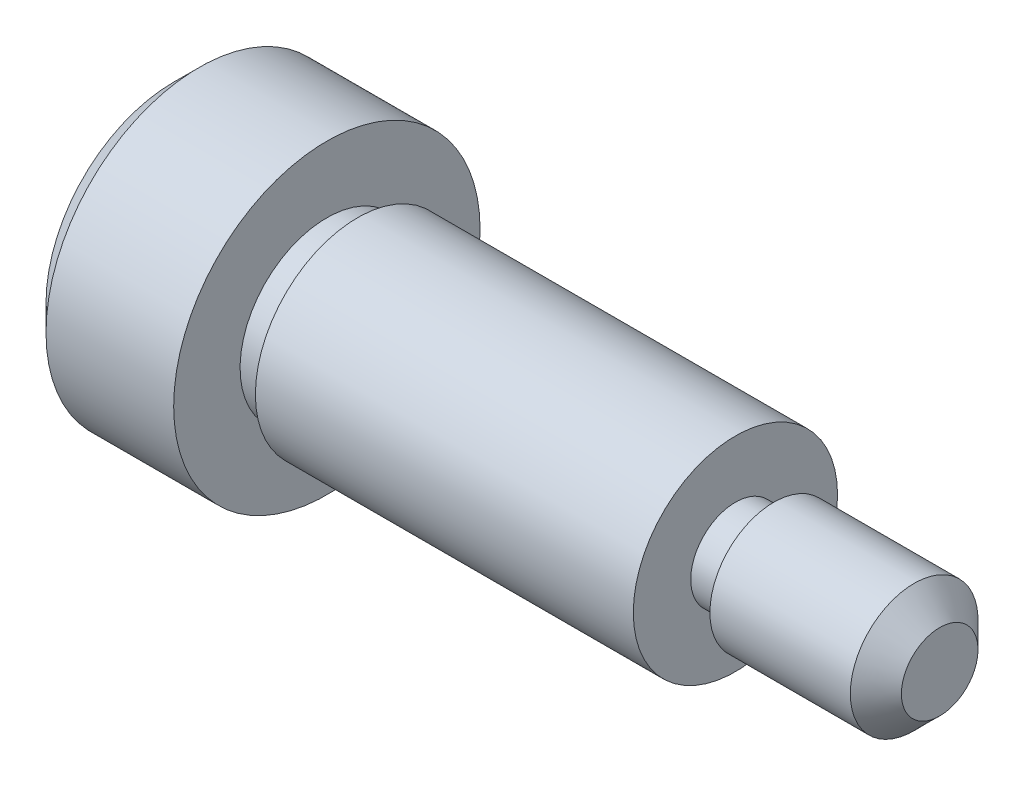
ISO-10303-21;
HEADER;
FILE_DESCRIPTION(('STEP AP214'),'2;1');
FILE_NAME('part.step','',(''),(''),'','','');
FILE_SCHEMA(('AUTOMOTIVE_DESIGN { 1 0 10303 214 1 1 1 1 }'));
ENDSEC;
DATA;
#1=APPLICATION_CONTEXT('core data for automotive mechanical design processes');
#2=APPLICATION_PROTOCOL_DEFINITION('international standard','automotive_design',2000,#1);
#3=PRODUCT_CONTEXT('',#1,'mechanical');
#4=PRODUCT('Part','Part','',(#3));
#5=PRODUCT_RELATED_PRODUCT_CATEGORY('part','',(#4));
#6=PRODUCT_DEFINITION_FORMATION('','',#4);
#7=PRODUCT_DEFINITION_CONTEXT('part definition',#1,'design');
#8=PRODUCT_DEFINITION('design','',#6,#7);
#9=PRODUCT_DEFINITION_SHAPE('','',#8);
#10=(LENGTH_UNIT() NAMED_UNIT(*) SI_UNIT(.MILLI.,.METRE.));
#11=(NAMED_UNIT(*) PLANE_ANGLE_UNIT() SI_UNIT($,.RADIAN.));
#12=(NAMED_UNIT(*) SI_UNIT($,.STERADIAN.) SOLID_ANGLE_UNIT());
#13=UNCERTAINTY_MEASURE_WITH_UNIT(LENGTH_MEASURE(1.E-05),#10,'distance_accuracy_value','');
#14=(GEOMETRIC_REPRESENTATION_CONTEXT(3) GLOBAL_UNCERTAINTY_ASSIGNED_CONTEXT((#13)) GLOBAL_UNIT_ASSIGNED_CONTEXT((#10,
#11,#12)) REPRESENTATION_CONTEXT('',''));
#15=CARTESIAN_POINT('',(0.,0.,0.));
#16=DIRECTION('',(0.,0.,1.));
#17=DIRECTION('',(1.,0.,0.));
#18=AXIS2_PLACEMENT_3D('',#15,#16,#17);
#19=CARTESIAN_POINT('',(0.,0.,0.));
#20=DIRECTION('',(-1.,0.,0.));
#21=DIRECTION('',(0.,0.,1.));
#22=AXIS2_PLACEMENT_3D('',#19,#20,#21);
#23=CYLINDRICAL_SURFACE('',#22,2.);
#24=CARTESIAN_POINT('',(8.,0.,0.));
#25=DIRECTION('',(-1.,0.,0.));
#26=DIRECTION('',(0.,0.,1.));
#27=AXIS2_PLACEMENT_3D('',#24,#25,#26);
#28=CIRCLE('',#27,2.);
#29=CARTESIAN_POINT('',(8.,0.,2.));
#30=VERTEX_POINT('',#29);
#31=EDGE_CURVE('E161',#30,#30,#28,.T.);
#32=ORIENTED_EDGE('',*,*,#31,.T.);
#33=EDGE_LOOP('',(#32));
#34=FACE_BOUND('',#33,.T.);
#35=CARTESIAN_POINT('',(0.600000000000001,0.,0.));
#36=DIRECTION('',(-1.,0.,0.));
#37=DIRECTION('',(0.,-1.,0.));
#38=AXIS2_PLACEMENT_3D('',#35,#36,#37);
#39=CIRCLE('',#38,2.);
#40=CARTESIAN_POINT('',(0.600000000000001,-2.,0.));
#41=VERTEX_POINT('',#40);
#42=EDGE_CURVE('E152',#41,#41,#39,.T.);
#43=ORIENTED_EDGE('',*,*,#42,.F.);
#44=EDGE_LOOP('',(#43));
#45=FACE_BOUND('',#44,.T.);
#46=ADVANCED_FACE('F36',(#34,#45),#23,.T.);
#47=CARTESIAN_POINT('',(8.,1.25,0.));
#48=DIRECTION('',(-1.,0.,0.));
#49=DIRECTION('',(0.,0.,1.));
#50=AXIS2_PLACEMENT_3D('',#47,#48,#49);
#51=PLANE('',#50);
#52=ORIENTED_EDGE('',*,*,#31,.F.);
#53=EDGE_LOOP('',(#52));
#54=FACE_BOUND('',#53,.T.);
#55=CARTESIAN_POINT('',(8.,0.,0.));
#56=DIRECTION('',(-1.,0.,0.));
#57=DIRECTION('',(0.,-1.,0.));
#58=AXIS2_PLACEMENT_3D('',#55,#56,#57);
#59=CIRCLE('',#58,0.875000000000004);
#60=CARTESIAN_POINT('',(8.,-0.875000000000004,0.));
#61=VERTEX_POINT('',#60);
#62=EDGE_CURVE('E146',#61,#61,#59,.T.);
#63=ORIENTED_EDGE('',*,*,#62,.T.);
#64=EDGE_LOOP('',(#63));
#65=FACE_BOUND('',#64,.T.);
#66=ADVANCED_FACE('F187',(#54,#65),#51,.F.);
#67=CARTESIAN_POINT('',(0.6,2.,0.));
#68=DIRECTION('',(-1.,0.,0.));
#69=DIRECTION('',(0.,-1.,0.));
#70=AXIS2_PLACEMENT_3D('',#67,#68,#69);
#71=PLANE('',#70);
#72=ORIENTED_EDGE('',*,*,#42,.T.);
#73=EDGE_LOOP('',(#72));
#74=FACE_BOUND('',#73,.T.);
#75=CARTESIAN_POINT('',(0.6,0.,0.));
#76=DIRECTION('',(-1.,0.,0.));
#77=DIRECTION('',(0.,-1.,0.));
#78=AXIS2_PLACEMENT_3D('',#75,#76,#77);
#79=CIRCLE('',#78,1.7);
#80=CARTESIAN_POINT('',(0.6,-1.7,0.));
#81=VERTEX_POINT('',#80);
#82=EDGE_CURVE('E158',#81,#81,#79,.T.);
#83=ORIENTED_EDGE('',*,*,#82,.F.);
#84=EDGE_LOOP('',(#83));
#85=FACE_BOUND('',#84,.T.);
#86=ADVANCED_FACE('F193',(#74,#85),#71,.T.);
#87=CARTESIAN_POINT('',(0.,0.,0.));
#88=DIRECTION('',(-1.,0.,0.));
#89=DIRECTION('',(0.,-1.,0.));
#90=AXIS2_PLACEMENT_3D('',#87,#88,#89);
#91=CYLINDRICAL_SURFACE('',#90,1.7);
#92=ORIENTED_EDGE('',*,*,#82,.T.);
#93=EDGE_LOOP('',(#92));
#94=FACE_BOUND('',#93,.T.);
#95=CARTESIAN_POINT('',(0.,0.,0.));
#96=DIRECTION('',(-1.,0.,0.));
#97=DIRECTION('',(0.,-1.,0.));
#98=AXIS2_PLACEMENT_3D('',#95,#96,#97);
#99=CIRCLE('',#98,1.7);
#100=CARTESIAN_POINT('',(0.,-1.7,0.));
#101=VERTEX_POINT('',#100);
#102=EDGE_CURVE('E155',#101,#101,#99,.T.);
#103=ORIENTED_EDGE('',*,*,#102,.F.);
#104=EDGE_LOOP('',(#103));
#105=FACE_BOUND('',#104,.T.);
#106=ADVANCED_FACE('F210',(#94,#105),#91,.T.);
#107=CARTESIAN_POINT('',(-3.,3.,0.));
#108=DIRECTION('',(1.,0.,0.));
#109=DIRECTION('',(0.,0.,-1.));
#110=AXIS2_PLACEMENT_3D('',#107,#108,#109);
#111=PLANE('',#110);
#112=CARTESIAN_POINT('',(-3.,0.,0.));
#113=DIRECTION('',(1.,0.,0.));
#114=DIRECTION('',(0.,0.,-1.));
#115=AXIS2_PLACEMENT_3D('',#112,#113,#114);
#116=CIRCLE('',#115,2.5);
#117=CARTESIAN_POINT('',(-3.,0.,-2.5));
#118=VERTEX_POINT('',#117);
#119=EDGE_CURVE('E44',#118,#118,#116,.F.);
#120=ORIENTED_EDGE('',*,*,#119,.T.);
#121=EDGE_LOOP('',(#120));
#122=FACE_BOUND('',#121,.T.);
#123=DIRECTION('',(0.,0.,-1.));
#124=VECTOR('',#123,1.);
#125=CARTESIAN_POINT('',(-3.,1.,0.577350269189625));
#126=LINE('',#125,#124);
#127=CARTESIAN_POINT('',(-3.,1.,0.577350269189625));
#128=VERTEX_POINT('',#127);
#129=CARTESIAN_POINT('',(-3.,0.999999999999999,-0.577350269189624));
#130=VERTEX_POINT('',#129);
#131=EDGE_CURVE('E125',#128,#130,#126,.T.);
#132=ORIENTED_EDGE('',*,*,#131,.F.);
#133=DIRECTION('',(0.,0.866025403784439,-0.5));
#134=VECTOR('',#133,1.);
#135=CARTESIAN_POINT('',(-3.,0.,1.15470053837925));
#136=LINE('',#135,#134);
#137=CARTESIAN_POINT('',(-3.,0.,1.15470053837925));
#138=VERTEX_POINT('',#137);
#139=EDGE_CURVE('E51',#138,#128,#136,.T.);
#140=ORIENTED_EDGE('',*,*,#139,.F.);
#141=DIRECTION('',(0.,0.866025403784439,0.5));
#142=VECTOR('',#141,1.);
#143=CARTESIAN_POINT('',(-3.,-1.,0.577350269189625));
#144=LINE('',#143,#142);
#145=CARTESIAN_POINT('',(-3.,-1.,0.577350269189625));
#146=VERTEX_POINT('',#145);
#147=EDGE_CURVE('E134',#146,#138,#144,.T.);
#148=ORIENTED_EDGE('',*,*,#147,.F.);
#149=DIRECTION('',(0.,0.,1.));
#150=VECTOR('',#149,1.);
#151=CARTESIAN_POINT('',(-3.,-1.,-0.577350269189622));
#152=LINE('',#151,#150);
#153=CARTESIAN_POINT('',(-3.,-1.,-0.577350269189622));
#154=VERTEX_POINT('',#153);
#155=EDGE_CURVE('E132',#154,#146,#152,.T.);
#156=ORIENTED_EDGE('',*,*,#155,.F.);
#157=DIRECTION('',(0.,-0.866025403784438,0.5));
#158=VECTOR('',#157,1.);
#159=CARTESIAN_POINT('',(-3.,0.,-1.15470053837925));
#160=LINE('',#159,#158);
#161=CARTESIAN_POINT('',(-3.,0.,-1.15470053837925));
#162=VERTEX_POINT('',#161);
#163=EDGE_CURVE('E99',#162,#154,#160,.T.);
#164=ORIENTED_EDGE('',*,*,#163,.F.);
#165=DIRECTION('',(0.,-0.866025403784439,-0.5));
#166=VECTOR('',#165,1.);
#167=CARTESIAN_POINT('',(-3.,0.999999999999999,-0.577350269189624));
#168=LINE('',#167,#166);
#169=EDGE_CURVE('E128',#130,#162,#168,.T.);
#170=ORIENTED_EDGE('',*,*,#169,.F.);
#171=EDGE_LOOP('',(#132,#140,#148,#156,#164,#170));
#172=FACE_BOUND('',#171,.T.);
#173=ADVANCED_FACE('F175',(#122,#172),#111,.F.);
#174=CARTESIAN_POINT('',(0.,0.,0.));
#175=DIRECTION('',(-1.,0.,0.));
#176=DIRECTION('',(0.,0.,1.));
#177=AXIS2_PLACEMENT_3D('',#174,#175,#176);
#178=CYLINDRICAL_SURFACE('',#177,3.);
#179=CARTESIAN_POINT('',(-2.5,0.,0.));
#180=DIRECTION('',(1.,0.,0.));
#181=DIRECTION('',(0.,0.,-1.));
#182=AXIS2_PLACEMENT_3D('',#179,#180,#181);
#183=CIRCLE('',#182,3.);
#184=CARTESIAN_POINT('',(-2.5,0.,-3.));
#185=VERTEX_POINT('',#184);
#186=EDGE_CURVE('E11',#185,#185,#183,.T.);
#187=ORIENTED_EDGE('',*,*,#186,.T.);
#188=EDGE_LOOP('',(#187));
#189=FACE_BOUND('',#188,.T.);
#190=CARTESIAN_POINT('',(0.,0.,0.));
#191=DIRECTION('',(-1.,0.,0.));
#192=DIRECTION('',(0.,0.,1.));
#193=AXIS2_PLACEMENT_3D('',#190,#191,#192);
#194=CIRCLE('',#193,3.);
#195=CARTESIAN_POINT('',(0.,0.,3.));
#196=VERTEX_POINT('',#195);
#197=EDGE_CURVE('E164',#196,#196,#194,.T.);
#198=ORIENTED_EDGE('',*,*,#197,.T.);
#199=EDGE_LOOP('',(#198));
#200=FACE_BOUND('',#199,.T.);
#201=ADVANCED_FACE('F203',(#189,#200),#178,.T.);
#202=CARTESIAN_POINT('',(0.,2.,0.));
#203=DIRECTION('',(-1.,0.,0.));
#204=DIRECTION('',(0.,0.,1.));
#205=AXIS2_PLACEMENT_3D('',#202,#203,#204);
#206=PLANE('',#205);
#207=ORIENTED_EDGE('',*,*,#197,.F.);
#208=EDGE_LOOP('',(#207));
#209=FACE_BOUND('',#208,.T.);
#210=ORIENTED_EDGE('',*,*,#102,.T.);
#211=EDGE_LOOP('',(#210));
#212=FACE_BOUND('',#211,.T.);
#213=ADVANCED_FACE('F199',(#209,#212),#206,.F.);
#214=CARTESIAN_POINT('',(8.75,1.25,0.));
#215=DIRECTION('',(-1.,0.,0.));
#216=DIRECTION('',(0.,-1.,0.));
#217=AXIS2_PLACEMENT_3D('',#214,#215,#216);
#218=PLANE('',#217);
#219=CARTESIAN_POINT('',(8.75,0.,0.));
#220=DIRECTION('',(-1.,0.,0.));
#221=DIRECTION('',(0.,-1.,0.));
#222=AXIS2_PLACEMENT_3D('',#219,#220,#221);
#223=CIRCLE('',#222,1.25);
#224=CARTESIAN_POINT('',(8.75,-1.25,0.));
#225=VERTEX_POINT('',#224);
#226=EDGE_CURVE('E138',#225,#225,#223,.T.);
#227=ORIENTED_EDGE('',*,*,#226,.T.);
#228=EDGE_LOOP('',(#227));
#229=FACE_BOUND('',#228,.T.);
#230=CARTESIAN_POINT('',(8.75,0.,0.));
#231=DIRECTION('',(-1.,0.,0.));
#232=DIRECTION('',(0.,-1.,0.));
#233=AXIS2_PLACEMENT_3D('',#230,#231,#232);
#234=CIRCLE('',#233,0.875000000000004);
#235=CARTESIAN_POINT('',(8.75,-0.875000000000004,0.));
#236=VERTEX_POINT('',#235);
#237=EDGE_CURVE('E149',#236,#236,#234,.T.);
#238=ORIENTED_EDGE('',*,*,#237,.F.);
#239=EDGE_LOOP('',(#238));
#240=FACE_BOUND('',#239,.T.);
#241=ADVANCED_FACE('F202',(#229,#240),#218,.T.);
#242=CARTESIAN_POINT('',(0.,0.,0.));
#243=DIRECTION('',(-1.,0.,0.));
#244=DIRECTION('',(0.,-1.,0.));
#245=AXIS2_PLACEMENT_3D('',#242,#243,#244);
#246=CYLINDRICAL_SURFACE('',#245,0.875000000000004);
#247=ORIENTED_EDGE('',*,*,#237,.T.);
#248=EDGE_LOOP('',(#247));
#249=FACE_BOUND('',#248,.T.);
#250=ORIENTED_EDGE('',*,*,#62,.F.);
#251=EDGE_LOOP('',(#250));
#252=FACE_BOUND('',#251,.T.);
#253=ADVANCED_FACE('F214',(#249,#252),#246,.T.);
#254=CARTESIAN_POINT('',(12.,0.,0.));
#255=DIRECTION('',(-1.,0.,0.));
#256=DIRECTION('',(0.,0.,1.));
#257=AXIS2_PLACEMENT_3D('',#254,#255,#256);
#258=PLANE('',#257);
#259=CARTESIAN_POINT('',(12.,0.,0.));
#260=DIRECTION('',(-1.,0.,0.));
#261=DIRECTION('',(0.,0.,1.));
#262=AXIS2_PLACEMENT_3D('',#259,#260,#261);
#263=CIRCLE('',#262,0.749999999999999);
#264=CARTESIAN_POINT('',(12.,0.,0.749999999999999));
#265=VERTEX_POINT('',#264);
#266=EDGE_CURVE('E170',#265,#265,#263,.F.);
#267=ORIENTED_EDGE('',*,*,#266,.T.);
#268=EDGE_LOOP('',(#267));
#269=FACE_BOUND('',#268,.T.);
#270=ADVANCED_FACE('F211',(#269),#258,.F.);
#271=CARTESIAN_POINT('',(0.,0.,0.));
#272=DIRECTION('',(-1.,0.,0.));
#273=DIRECTION('',(0.,0.,1.));
#274=AXIS2_PLACEMENT_3D('',#271,#272,#273);
#275=CYLINDRICAL_SURFACE('',#274,1.25);
#276=CARTESIAN_POINT('',(11.5,0.,0.));
#277=DIRECTION('',(-1.,0.,0.));
#278=DIRECTION('',(0.,0.,1.));
#279=AXIS2_PLACEMENT_3D('',#276,#277,#278);
#280=CIRCLE('',#279,1.25);
#281=CARTESIAN_POINT('',(11.5,0.,1.25));
#282=VERTEX_POINT('',#281);
#283=EDGE_CURVE('E167',#282,#282,#280,.T.);
#284=ORIENTED_EDGE('',*,*,#283,.T.);
#285=EDGE_LOOP('',(#284));
#286=FACE_BOUND('',#285,.T.);
#287=ORIENTED_EDGE('',*,*,#226,.F.);
#288=EDGE_LOOP('',(#287));
#289=FACE_BOUND('',#288,.T.);
#290=ADVANCED_FACE('F213',(#286,#289),#275,.T.);
#291=CARTESIAN_POINT('',(-1.4,0.,1.15470053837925));
#292=DIRECTION('',(0.,0.5,0.866025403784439));
#293=DIRECTION('',(0.,-0.866025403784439,0.5));
#294=AXIS2_PLACEMENT_3D('',#291,#292,#293);
#295=PLANE('',#294);
#296=ORIENTED_EDGE('',*,*,#139,.T.);
#297=DIRECTION('',(-1.,0.,0.));
#298=VECTOR('',#297,1.);
#299=CARTESIAN_POINT('',(-1.4,1.,0.577350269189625));
#300=LINE('',#299,#298);
#301=CARTESIAN_POINT('',(-1.4,1.,0.577350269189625));
#302=VERTEX_POINT('',#301);
#303=EDGE_CURVE('E81',#302,#128,#300,.T.);
#304=ORIENTED_EDGE('',*,*,#303,.F.);
#305=DIRECTION('',(0.,0.866025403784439,-0.5));
#306=VECTOR('',#305,1.);
#307=CARTESIAN_POINT('',(-1.4,0.,1.15470053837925));
#308=LINE('',#307,#306);
#309=CARTESIAN_POINT('',(-1.4,0.,1.15470053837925));
#310=VERTEX_POINT('',#309);
#311=EDGE_CURVE('E136',#310,#302,#308,.T.);
#312=ORIENTED_EDGE('',*,*,#311,.F.);
#313=DIRECTION('',(-1.,0.,0.));
#314=VECTOR('',#313,1.);
#315=CARTESIAN_POINT('',(-1.4,0.,1.15470053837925));
#316=LINE('',#315,#314);
#317=EDGE_CURVE('E59',#310,#138,#316,.T.);
#318=ORIENTED_EDGE('',*,*,#317,.T.);
#319=EDGE_LOOP('',(#296,#304,#312,#318));
#320=FACE_BOUND('',#319,.T.);
#321=ADVANCED_FACE('F220',(#320),#295,.F.);
#322=CARTESIAN_POINT('',(-1.4,-1.,0.577350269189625));
#323=DIRECTION('',(0.,-0.5,0.866025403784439));
#324=DIRECTION('',(0.,-0.866025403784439,-0.5));
#325=AXIS2_PLACEMENT_3D('',#322,#323,#324);
#326=PLANE('',#325);
#327=ORIENTED_EDGE('',*,*,#147,.T.);
#328=ORIENTED_EDGE('',*,*,#317,.F.);
#329=DIRECTION('',(0.,0.866025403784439,0.5));
#330=VECTOR('',#329,1.);
#331=CARTESIAN_POINT('',(-1.4,-1.,0.577350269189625));
#332=LINE('',#331,#330);
#333=CARTESIAN_POINT('',(-1.4,-1.,0.577350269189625));
#334=VERTEX_POINT('',#333);
#335=EDGE_CURVE('E111',#334,#310,#332,.T.);
#336=ORIENTED_EDGE('',*,*,#335,.F.);
#337=DIRECTION('',(-1.,0.,0.));
#338=VECTOR('',#337,1.);
#339=CARTESIAN_POINT('',(-1.4,-1.,0.577350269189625));
#340=LINE('',#339,#338);
#341=EDGE_CURVE('E103',#334,#146,#340,.T.);
#342=ORIENTED_EDGE('',*,*,#341,.T.);
#343=EDGE_LOOP('',(#327,#328,#336,#342));
#344=FACE_BOUND('',#343,.T.);
#345=ADVANCED_FACE('F293',(#344),#326,.F.);
#346=CARTESIAN_POINT('',(-1.4,-1.,-0.577350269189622));
#347=DIRECTION('',(0.,-1.,0.));
#348=DIRECTION('',(0.,0.,-1.));
#349=AXIS2_PLACEMENT_3D('',#346,#347,#348);
#350=PLANE('',#349);
#351=ORIENTED_EDGE('',*,*,#155,.T.);
#352=ORIENTED_EDGE('',*,*,#341,.F.);
#353=DIRECTION('',(0.,0.,1.));
#354=VECTOR('',#353,1.);
#355=CARTESIAN_POINT('',(-1.4,-1.,-0.577350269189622));
#356=LINE('',#355,#354);
#357=CARTESIAN_POINT('',(-1.4,-1.,-0.577350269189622));
#358=VERTEX_POINT('',#357);
#359=EDGE_CURVE('E107',#358,#334,#356,.T.);
#360=ORIENTED_EDGE('',*,*,#359,.F.);
#361=DIRECTION('',(-1.,0.,0.));
#362=VECTOR('',#361,1.);
#363=CARTESIAN_POINT('',(-1.4,-1.,-0.577350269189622));
#364=LINE('',#363,#362);
#365=EDGE_CURVE('E92',#358,#154,#364,.T.);
#366=ORIENTED_EDGE('',*,*,#365,.T.);
#367=EDGE_LOOP('',(#351,#352,#360,#366));
#368=FACE_BOUND('',#367,.T.);
#369=ADVANCED_FACE('F108',(#368),#350,.F.);
#370=CARTESIAN_POINT('',(-1.4,0.,-1.15470053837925));
#371=DIRECTION('',(0.,-0.5,-0.866025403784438));
#372=DIRECTION('',(0.,0.866025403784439,-0.5));
#373=AXIS2_PLACEMENT_3D('',#370,#371,#372);
#374=PLANE('',#373);
#375=ORIENTED_EDGE('',*,*,#163,.T.);
#376=ORIENTED_EDGE('',*,*,#365,.F.);
#377=DIRECTION('',(0.,-0.866025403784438,0.5));
#378=VECTOR('',#377,1.);
#379=CARTESIAN_POINT('',(-1.4,0.,-1.15470053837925));
#380=LINE('',#379,#378);
#381=CARTESIAN_POINT('',(-1.4,0.,-1.15470053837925));
#382=VERTEX_POINT('',#381);
#383=EDGE_CURVE('E96',#382,#358,#380,.T.);
#384=ORIENTED_EDGE('',*,*,#383,.F.);
#385=DIRECTION('',(-1.,0.,0.));
#386=VECTOR('',#385,1.);
#387=CARTESIAN_POINT('',(-1.4,0.,-1.15470053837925));
#388=LINE('',#387,#386);
#389=EDGE_CURVE('E104',#382,#162,#388,.T.);
#390=ORIENTED_EDGE('',*,*,#389,.T.);
#391=EDGE_LOOP('',(#375,#376,#384,#390));
#392=FACE_BOUND('',#391,.T.);
#393=ADVANCED_FACE('F94',(#392),#374,.F.);
#394=CARTESIAN_POINT('',(-1.4,0.999999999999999,-0.577350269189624));
#395=DIRECTION('',(0.,0.5,-0.866025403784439));
#396=DIRECTION('',(0.,0.866025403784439,0.5));
#397=AXIS2_PLACEMENT_3D('',#394,#395,#396);
#398=PLANE('',#397);
#399=ORIENTED_EDGE('',*,*,#169,.T.);
#400=ORIENTED_EDGE('',*,*,#389,.F.);
#401=DIRECTION('',(0.,-0.866025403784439,-0.5));
#402=VECTOR('',#401,1.);
#403=CARTESIAN_POINT('',(-1.4,0.999999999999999,-0.577350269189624));
#404=LINE('',#403,#402);
#405=CARTESIAN_POINT('',(-1.4,0.999999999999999,-0.577350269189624));
#406=VERTEX_POINT('',#405);
#407=EDGE_CURVE('E117',#406,#382,#404,.T.);
#408=ORIENTED_EDGE('',*,*,#407,.F.);
#409=DIRECTION('',(-1.,0.,0.));
#410=VECTOR('',#409,1.);
#411=CARTESIAN_POINT('',(-1.4,0.999999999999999,-0.577350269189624));
#412=LINE('',#411,#410);
#413=EDGE_CURVE('E141',#406,#130,#412,.T.);
#414=ORIENTED_EDGE('',*,*,#413,.T.);
#415=EDGE_LOOP('',(#399,#400,#408,#414));
#416=FACE_BOUND('',#415,.T.);
#417=ADVANCED_FACE('F317',(#416),#398,.F.);
#418=CARTESIAN_POINT('',(-1.4,1.,0.577350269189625));
#419=DIRECTION('',(0.,1.,0.));
#420=DIRECTION('',(0.,0.,1.));
#421=AXIS2_PLACEMENT_3D('',#418,#419,#420);
#422=PLANE('',#421);
#423=ORIENTED_EDGE('',*,*,#131,.T.);
#424=ORIENTED_EDGE('',*,*,#413,.F.);
#425=DIRECTION('',(0.,0.,-1.));
#426=VECTOR('',#425,1.);
#427=CARTESIAN_POINT('',(-1.4,1.,0.577350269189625));
#428=LINE('',#427,#426);
#429=EDGE_CURVE('E119',#302,#406,#428,.T.);
#430=ORIENTED_EDGE('',*,*,#429,.F.);
#431=ORIENTED_EDGE('',*,*,#303,.T.);
#432=EDGE_LOOP('',(#423,#424,#430,#431));
#433=FACE_BOUND('',#432,.T.);
#434=ADVANCED_FACE('F326',(#433),#422,.F.);
#435=CARTESIAN_POINT('',(-1.4,1.,0.577350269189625));
#436=DIRECTION('',(-1.,0.,0.));
#437=DIRECTION('',(0.,0.,1.));
#438=AXIS2_PLACEMENT_3D('',#435,#436,#437);
#439=PLANE('',#438);
#440=ORIENTED_EDGE('',*,*,#311,.T.);
#441=ORIENTED_EDGE('',*,*,#429,.T.);
#442=ORIENTED_EDGE('',*,*,#407,.T.);
#443=ORIENTED_EDGE('',*,*,#383,.T.);
#444=ORIENTED_EDGE('',*,*,#359,.T.);
#445=ORIENTED_EDGE('',*,*,#335,.T.);
#446=EDGE_LOOP('',(#440,#441,#442,#443,#444,#445));
#447=FACE_BOUND('',#446,.T.);
#448=ADVANCED_FACE('F114',(#447),#439,.T.);
#449=CARTESIAN_POINT('',(11.5,0.,0.));
#450=DIRECTION('',(-1.,0.,0.));
#451=DIRECTION('',(0.,0.,1.));
#452=AXIS2_PLACEMENT_3D('',#449,#450,#451);
#453=CONICAL_SURFACE('',#452,1.25,0.785398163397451);
#454=ORIENTED_EDGE('',*,*,#266,.F.);
#455=EDGE_LOOP('',(#454));
#456=FACE_BOUND('',#455,.T.);
#457=ORIENTED_EDGE('',*,*,#283,.F.);
#458=EDGE_LOOP('',(#457));
#459=FACE_BOUND('',#458,.T.);
#460=ADVANCED_FACE('F179',(#456,#459),#453,.T.);
#461=CARTESIAN_POINT('',(-3.,0.,0.));
#462=DIRECTION('',(1.,0.,0.));
#463=DIRECTION('',(0.,0.,-1.));
#464=AXIS2_PLACEMENT_3D('',#461,#462,#463);
#465=CONICAL_SURFACE('',#464,2.5,0.785398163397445);
#466=ORIENTED_EDGE('',*,*,#186,.F.);
#467=EDGE_LOOP('',(#466));
#468=FACE_BOUND('',#467,.T.);
#469=ORIENTED_EDGE('',*,*,#119,.F.);
#470=EDGE_LOOP('',(#469));
#471=FACE_BOUND('',#470,.T.);
#472=ADVANCED_FACE('F38',(#468,#471),#465,.T.);
#473=CLOSED_SHELL('',(#46,#66,#86,#106,#173,#201,#213,#241,#253,#270,#290,#321,#345,#369,#393,
#417,#434,#448,#460,#472));
#474=MANIFOLD_SOLID_BREP('B2',#473);
#475=ADVANCED_BREP_SHAPE_REPRESENTATION('',(#18,#474),#14);
#476=SHAPE_DEFINITION_REPRESENTATION(#9,#475);
ENDSEC;
END-ISO-10303-21;
